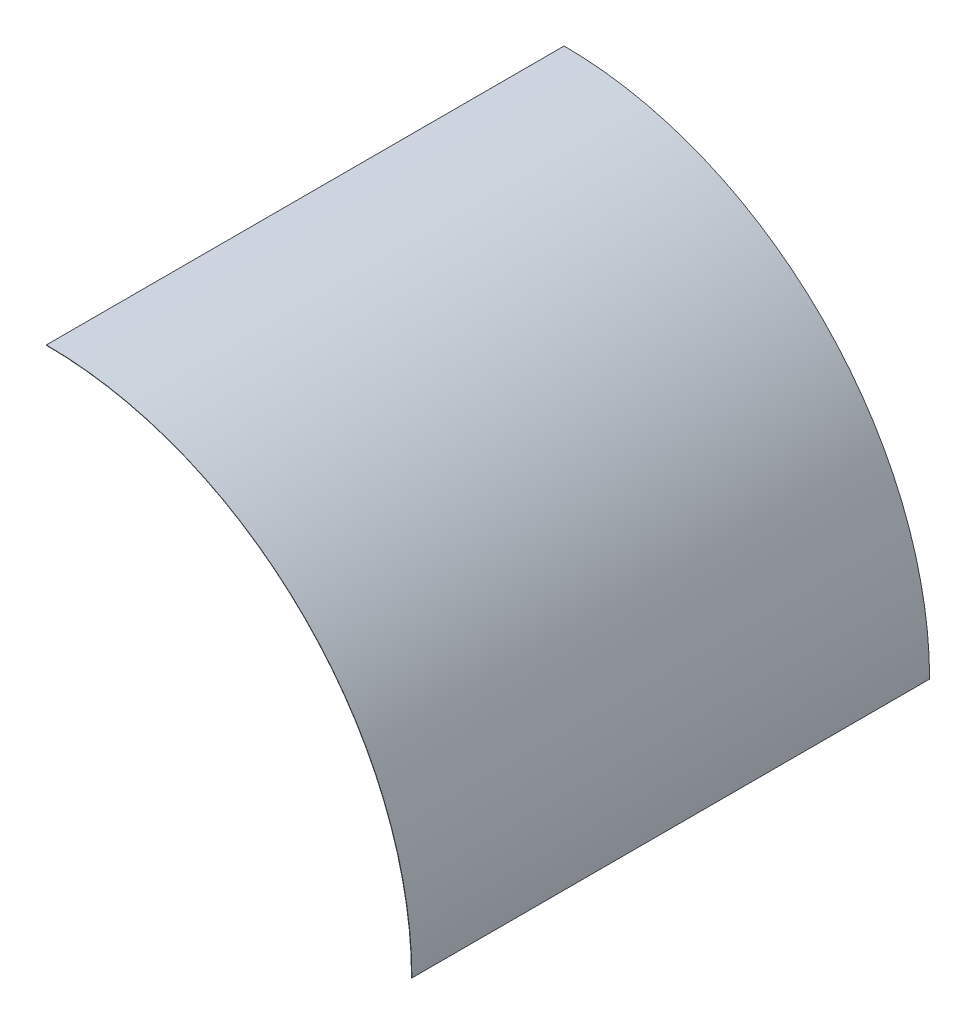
ISO-10303-21;
HEADER;
FILE_DESCRIPTION(('STEP AP214'),'2;1');
FILE_NAME('part.step','',(''),(''),'','','');
FILE_SCHEMA(('AUTOMOTIVE_DESIGN { 1 0 10303 214 1 1 1 1 }'));
ENDSEC;
DATA;
#1=APPLICATION_CONTEXT('core data for automotive mechanical design processes');
#2=APPLICATION_PROTOCOL_DEFINITION('international standard','automotive_design',2000,#1);
#3=PRODUCT_CONTEXT('',#1,'mechanical');
#4=PRODUCT('Part','Part','',(#3));
#5=PRODUCT_RELATED_PRODUCT_CATEGORY('part','',(#4));
#6=PRODUCT_DEFINITION_FORMATION('','',#4);
#7=PRODUCT_DEFINITION_CONTEXT('part definition',#1,'design');
#8=PRODUCT_DEFINITION('design','',#6,#7);
#9=PRODUCT_DEFINITION_SHAPE('','',#8);
#10=(LENGTH_UNIT() NAMED_UNIT(*) SI_UNIT(.MILLI.,.METRE.));
#11=(NAMED_UNIT(*) PLANE_ANGLE_UNIT() SI_UNIT($,.RADIAN.));
#12=(NAMED_UNIT(*) SI_UNIT($,.STERADIAN.) SOLID_ANGLE_UNIT());
#13=UNCERTAINTY_MEASURE_WITH_UNIT(LENGTH_MEASURE(1.E-05),#10,'distance_accuracy_value','');
#14=(GEOMETRIC_REPRESENTATION_CONTEXT(3) GLOBAL_UNCERTAINTY_ASSIGNED_CONTEXT((#13)) GLOBAL_UNIT_ASSIGNED_CONTEXT((#10,
#11,#12)) REPRESENTATION_CONTEXT('',''));
#15=CARTESIAN_POINT('',(0.,0.,0.));
#16=DIRECTION('',(0.,0.,1.));
#17=DIRECTION('',(1.,0.,0.));
#18=AXIS2_PLACEMENT_3D('',#15,#16,#17);
#19=CARTESIAN_POINT('',(0.,0.,-3000.));
#20=DIRECTION('',(0.,0.,1.));
#21=DIRECTION('',(1.,0.,0.));
#22=AXIS2_PLACEMENT_3D('',#19,#20,#21);
#23=CYLINDRICAL_SURFACE('',#22,2116.);
#24=CARTESIAN_POINT('',(0.,0.,0.));
#25=DIRECTION('',(0.,0.,-1.));
#26=DIRECTION('',(-1.,0.,0.));
#27=AXIS2_PLACEMENT_3D('',#24,#25,#26);
#28=CIRCLE('',#27,2116.);
#29=CARTESIAN_POINT('',(0.,2116.,0.));
#30=VERTEX_POINT('',#29);
#31=CARTESIAN_POINT('',(2116.,0.,0.));
#32=VERTEX_POINT('',#31);
#33=EDGE_CURVE('E101',#30,#32,#28,.T.);
#34=ORIENTED_EDGE('',*,*,#33,.F.);
#35=DIRECTION('',(0.,0.,1.));
#36=VECTOR('',#35,1.);
#37=CARTESIAN_POINT('',(0.,2116.,-3000.));
#38=LINE('',#37,#36);
#39=CARTESIAN_POINT('',(0.,2116.,-3000.));
#40=VERTEX_POINT('',#39);
#41=EDGE_CURVE('E11',#40,#30,#38,.T.);
#42=ORIENTED_EDGE('',*,*,#41,.F.);
#43=CARTESIAN_POINT('',(0.,0.,-3000.));
#44=DIRECTION('',(0.,0.,-1.));
#45=DIRECTION('',(-1.,0.,0.));
#46=AXIS2_PLACEMENT_3D('',#43,#44,#45);
#47=CIRCLE('',#46,2116.);
#48=CARTESIAN_POINT('',(2116.,0.,-3000.));
#49=VERTEX_POINT('',#48);
#50=EDGE_CURVE('E95',#40,#49,#47,.T.);
#51=ORIENTED_EDGE('',*,*,#50,.T.);
#52=DIRECTION('',(0.,0.,1.));
#53=VECTOR('',#52,1.);
#54=CARTESIAN_POINT('',(2116.,0.,-3000.));
#55=LINE('',#54,#53);
#56=EDGE_CURVE('E40',#49,#32,#55,.T.);
#57=ORIENTED_EDGE('',*,*,#56,.T.);
#58=EDGE_LOOP('',(#34,#42,#51,#57));
#59=FACE_BOUND('',#58,.T.);
#60=ADVANCED_FACE('F37',(#59),#23,.F.);
#61=CARTESIAN_POINT('',(0.,2118.,-3000.));
#62=DIRECTION('',(-1.,0.,0.));
#63=DIRECTION('',(0.,0.,1.));
#64=AXIS2_PLACEMENT_3D('',#61,#62,#63);
#65=PLANE('',#64);
#66=DIRECTION('',(0.,-1.,0.));
#67=VECTOR('',#66,1.);
#68=CARTESIAN_POINT('',(0.,2118.,0.));
#69=LINE('',#68,#67);
#70=CARTESIAN_POINT('',(0.,2118.,0.));
#71=VERTEX_POINT('',#70);
#72=EDGE_CURVE('E97',#71,#30,#69,.T.);
#73=ORIENTED_EDGE('',*,*,#72,.F.);
#74=DIRECTION('',(0.,0.,1.));
#75=VECTOR('',#74,1.);
#76=CARTESIAN_POINT('',(0.,2118.,-3000.));
#77=LINE('',#76,#75);
#78=CARTESIAN_POINT('',(0.,2118.,-3000.));
#79=VERTEX_POINT('',#78);
#80=EDGE_CURVE('E46',#79,#71,#77,.T.);
#81=ORIENTED_EDGE('',*,*,#80,.F.);
#82=DIRECTION('',(0.,-1.,0.));
#83=VECTOR('',#82,1.);
#84=CARTESIAN_POINT('',(0.,2118.,-3000.));
#85=LINE('',#84,#83);
#86=EDGE_CURVE('E92',#79,#40,#85,.T.);
#87=ORIENTED_EDGE('',*,*,#86,.T.);
#88=ORIENTED_EDGE('',*,*,#41,.T.);
#89=EDGE_LOOP('',(#73,#81,#87,#88));
#90=FACE_BOUND('',#89,.T.);
#91=ADVANCED_FACE('F111',(#90),#65,.T.);
#92=CARTESIAN_POINT('',(0.,0.,-3000.));
#93=DIRECTION('',(0.,0.,1.));
#94=DIRECTION('',(1.,0.,0.));
#95=AXIS2_PLACEMENT_3D('',#92,#93,#94);
#96=CYLINDRICAL_SURFACE('',#95,2118.);
#97=CARTESIAN_POINT('',(0.,0.,0.));
#98=DIRECTION('',(0.,0.,1.));
#99=DIRECTION('',(-1.,0.,0.));
#100=AXIS2_PLACEMENT_3D('',#97,#98,#99);
#101=CIRCLE('',#100,2118.);
#102=CARTESIAN_POINT('',(2118.,2.59380192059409E-13,0.));
#103=VERTEX_POINT('',#102);
#104=EDGE_CURVE('E87',#103,#71,#101,.T.);
#105=ORIENTED_EDGE('',*,*,#104,.F.);
#106=DIRECTION('',(0.,0.,1.));
#107=VECTOR('',#106,1.);
#108=CARTESIAN_POINT('',(2118.,2.59380192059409E-13,-3000.));
#109=LINE('',#108,#107);
#110=CARTESIAN_POINT('',(2118.,2.59380192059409E-13,-3000.));
#111=VERTEX_POINT('',#110);
#112=EDGE_CURVE('E82',#111,#103,#109,.T.);
#113=ORIENTED_EDGE('',*,*,#112,.F.);
#114=CARTESIAN_POINT('',(0.,0.,-3000.));
#115=DIRECTION('',(0.,0.,1.));
#116=DIRECTION('',(-1.,0.,0.));
#117=AXIS2_PLACEMENT_3D('',#114,#115,#116);
#118=CIRCLE('',#117,2118.);
#119=EDGE_CURVE('E85',#111,#79,#118,.T.);
#120=ORIENTED_EDGE('',*,*,#119,.T.);
#121=ORIENTED_EDGE('',*,*,#80,.T.);
#122=EDGE_LOOP('',(#105,#113,#120,#121));
#123=FACE_BOUND('',#122,.T.);
#124=ADVANCED_FACE('F84',(#123),#96,.T.);
#125=CARTESIAN_POINT('',(2118.,0.,-3000.));
#126=DIRECTION('',(0.,-1.,0.));
#127=DIRECTION('',(0.,0.,-1.));
#128=AXIS2_PLACEMENT_3D('',#125,#126,#127);
#129=PLANE('',#128);
#130=DIRECTION('',(1.,0.,0.));
#131=VECTOR('',#130,1.);
#132=CARTESIAN_POINT('',(2118.,0.,0.));
#133=LINE('',#132,#131);
#134=EDGE_CURVE('E104',#32,#103,#133,.T.);
#135=ORIENTED_EDGE('',*,*,#134,.F.);
#136=ORIENTED_EDGE('',*,*,#56,.F.);
#137=DIRECTION('',(1.,0.,0.));
#138=VECTOR('',#137,1.);
#139=CARTESIAN_POINT('',(2118.,0.,-3000.));
#140=LINE('',#139,#138);
#141=EDGE_CURVE('E91',#49,#111,#140,.T.);
#142=ORIENTED_EDGE('',*,*,#141,.T.);
#143=ORIENTED_EDGE('',*,*,#112,.T.);
#144=EDGE_LOOP('',(#135,#136,#142,#143));
#145=FACE_BOUND('',#144,.T.);
#146=ADVANCED_FACE('F94',(#145),#129,.T.);
#147=CARTESIAN_POINT('',(0.,0.,-3000.));
#148=DIRECTION('',(0.,0.,-1.));
#149=DIRECTION('',(-1.,0.,0.));
#150=AXIS2_PLACEMENT_3D('',#147,#148,#149);
#151=PLANE('',#150);
#152=ORIENTED_EDGE('',*,*,#50,.F.);
#153=ORIENTED_EDGE('',*,*,#86,.F.);
#154=ORIENTED_EDGE('',*,*,#119,.F.);
#155=ORIENTED_EDGE('',*,*,#141,.F.);
#156=EDGE_LOOP('',(#152,#153,#154,#155));
#157=FACE_BOUND('',#156,.T.);
#158=ADVANCED_FACE('F90',(#157),#151,.T.);
#159=CARTESIAN_POINT('',(0.,0.,0.));
#160=DIRECTION('',(0.,0.,-1.));
#161=DIRECTION('',(-1.,0.,0.));
#162=AXIS2_PLACEMENT_3D('',#159,#160,#161);
#163=PLANE('',#162);
#164=ORIENTED_EDGE('',*,*,#33,.T.);
#165=ORIENTED_EDGE('',*,*,#134,.T.);
#166=ORIENTED_EDGE('',*,*,#104,.T.);
#167=ORIENTED_EDGE('',*,*,#72,.T.);
#168=EDGE_LOOP('',(#164,#165,#166,#167));
#169=FACE_BOUND('',#168,.T.);
#170=ADVANCED_FACE('F110',(#169),#163,.F.);
#171=CLOSED_SHELL('',(#60,#91,#124,#146,#158,#170));
#172=MANIFOLD_SOLID_BREP('B2',#171);
#173=ADVANCED_BREP_SHAPE_REPRESENTATION('',(#18,#172),#14);
#174=SHAPE_DEFINITION_REPRESENTATION(#9,#173);
ENDSEC;
END-ISO-10303-21;
